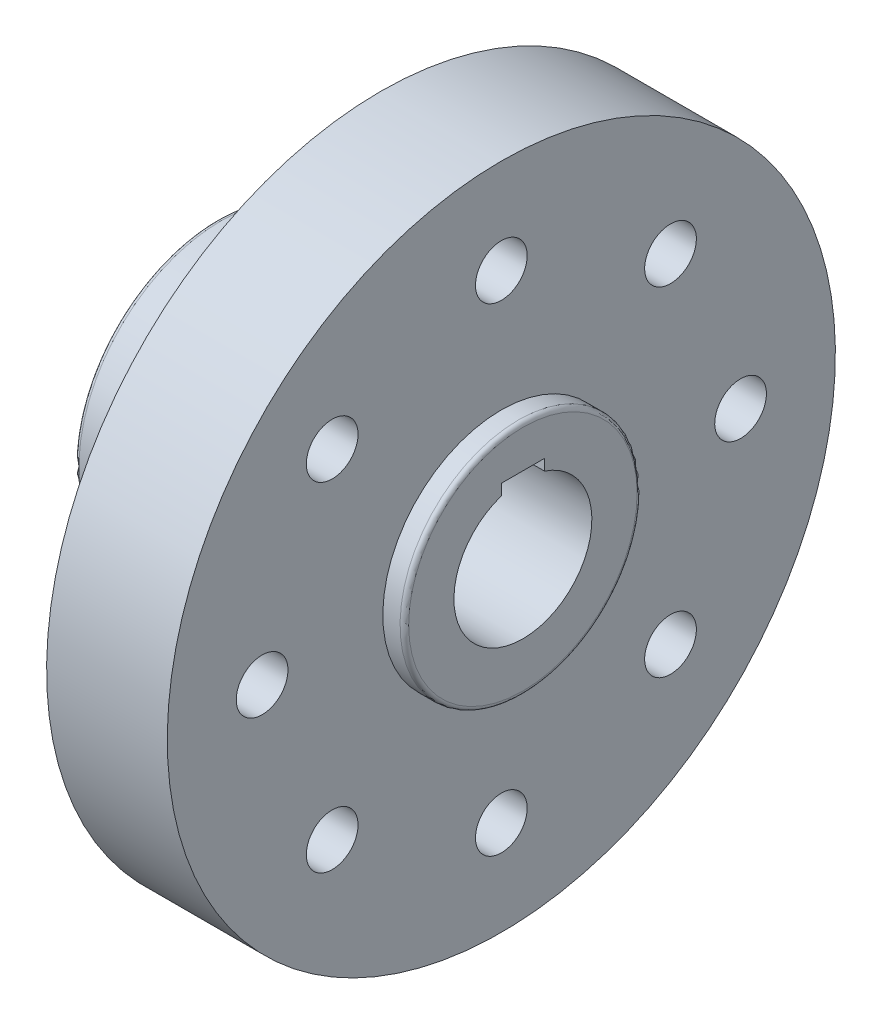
ISO-10303-21;
HEADER;
FILE_DESCRIPTION(('STEP AP214'),'2;1');
FILE_NAME('part.step','',(''),(''),'','','');
FILE_SCHEMA(('AUTOMOTIVE_DESIGN { 1 0 10303 214 1 1 1 1 }'));
ENDSEC;
DATA;
#1=APPLICATION_CONTEXT('core data for automotive mechanical design processes');
#2=APPLICATION_PROTOCOL_DEFINITION('international standard','automotive_design',2000,#1);
#3=PRODUCT_CONTEXT('',#1,'mechanical');
#4=PRODUCT('Part','Part','',(#3));
#5=PRODUCT_RELATED_PRODUCT_CATEGORY('part','',(#4));
#6=PRODUCT_DEFINITION_FORMATION('','',#4);
#7=PRODUCT_DEFINITION_CONTEXT('part definition',#1,'design');
#8=PRODUCT_DEFINITION('design','',#6,#7);
#9=PRODUCT_DEFINITION_SHAPE('','',#8);
#10=(LENGTH_UNIT() NAMED_UNIT(*) SI_UNIT(.MILLI.,.METRE.));
#11=(NAMED_UNIT(*) PLANE_ANGLE_UNIT() SI_UNIT($,.RADIAN.));
#12=(NAMED_UNIT(*) SI_UNIT($,.STERADIAN.) SOLID_ANGLE_UNIT());
#13=UNCERTAINTY_MEASURE_WITH_UNIT(LENGTH_MEASURE(1.E-05),#10,'distance_accuracy_value','');
#14=(GEOMETRIC_REPRESENTATION_CONTEXT(3) GLOBAL_UNCERTAINTY_ASSIGNED_CONTEXT((#13)) GLOBAL_UNIT_ASSIGNED_CONTEXT((#10,
#11,#12)) REPRESENTATION_CONTEXT('',''));
#15=CARTESIAN_POINT('',(0.,0.,0.));
#16=DIRECTION('',(0.,0.,1.));
#17=DIRECTION('',(1.,0.,0.));
#18=AXIS2_PLACEMENT_3D('',#15,#16,#17);
#19=CARTESIAN_POINT('',(29.1143281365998,0.,0.));
#20=DIRECTION('',(1.,0.,0.));
#21=DIRECTION('',(0.,1.,0.));
#22=AXIS2_PLACEMENT_3D('',#19,#20,#21);
#23=PLANE('',#22);
#24=CARTESIAN_POINT('',(29.1143281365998,0.,0.));
#25=DIRECTION('',(1.,0.,0.));
#26=DIRECTION('',(0.,1.,0.));
#27=AXIS2_PLACEMENT_3D('',#24,#25,#26);
#28=CIRCLE('',#27,26.5);
#29=CARTESIAN_POINT('',(29.1143281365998,26.5,0.));
#30=VERTEX_POINT('',#29);
#31=EDGE_CURVE('E240',#30,#30,#28,.T.);
#32=ORIENTED_EDGE('',*,*,#31,.T.);
#33=EDGE_LOOP('',(#32));
#34=FACE_BOUND('',#33,.T.);
#35=DIRECTION('',(0.,0.,-1.));
#36=VECTOR('',#35,1.);
#37=CARTESIAN_POINT('',(29.1143281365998,17.75,5.));
#38=LINE('',#37,#36);
#39=CARTESIAN_POINT('',(29.1143281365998,17.75,5.));
#40=VERTEX_POINT('',#39);
#41=CARTESIAN_POINT('',(29.1143281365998,17.75,-5.));
#42=VERTEX_POINT('',#41);
#43=EDGE_CURVE('E161',#40,#42,#38,.T.);
#44=ORIENTED_EDGE('',*,*,#43,.T.);
#45=DIRECTION('',(0.,-1.,0.));
#46=VECTOR('',#45,1.);
#47=CARTESIAN_POINT('',(29.1143281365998,17.75,-5.));
#48=LINE('',#47,#46);
#49=CARTESIAN_POINT('',(29.1143281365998,15.1986841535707,-5.));
#50=VERTEX_POINT('',#49);
#51=EDGE_CURVE('E140',#42,#50,#48,.T.);
#52=ORIENTED_EDGE('',*,*,#51,.T.);
#53=CARTESIAN_POINT('',(29.1143281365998,0.,0.));
#54=DIRECTION('',(1.,0.,0.));
#55=DIRECTION('',(0.,0.,-1.));
#56=AXIS2_PLACEMENT_3D('',#53,#54,#55);
#57=CIRCLE('',#56,16.);
#58=CARTESIAN_POINT('',(29.1143281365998,15.1986841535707,5.));
#59=VERTEX_POINT('',#58);
#60=EDGE_CURVE('E124',#59,#50,#57,.T.);
#61=ORIENTED_EDGE('',*,*,#60,.F.);
#62=DIRECTION('',(0.,-1.,0.));
#63=VECTOR('',#62,1.);
#64=CARTESIAN_POINT('',(29.1143281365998,17.75,5.));
#65=LINE('',#64,#63);
#66=EDGE_CURVE('E133',#40,#59,#65,.T.);
#67=ORIENTED_EDGE('',*,*,#66,.F.);
#68=EDGE_LOOP('',(#44,#52,#61,#67));
#69=FACE_BOUND('',#68,.T.);
#70=ADVANCED_FACE('F69',(#34,#69),#23,.T.);
#71=CARTESIAN_POINT('',(-41.8856718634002,33.,0.));
#72=DIRECTION('',(-1.,0.,0.));
#73=DIRECTION('',(0.,-1.,0.));
#74=AXIS2_PLACEMENT_3D('',#71,#72,#73);
#75=PLANE('',#74);
#76=CARTESIAN_POINT('',(-41.8856718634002,0.,0.));
#77=DIRECTION('',(-1.,0.,0.));
#78=DIRECTION('',(0.,-1.,0.));
#79=AXIS2_PLACEMENT_3D('',#76,#77,#78);
#80=CIRCLE('',#79,32.);
#81=CARTESIAN_POINT('',(-41.8856718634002,-32.,0.));
#82=VERTEX_POINT('',#81);
#83=EDGE_CURVE('E252',#82,#82,#80,.T.);
#84=ORIENTED_EDGE('',*,*,#83,.T.);
#85=EDGE_LOOP('',(#84));
#86=FACE_BOUND('',#85,.T.);
#87=DIRECTION('',(0.,-1.,0.));
#88=VECTOR('',#87,1.);
#89=CARTESIAN_POINT('',(-41.8856718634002,17.75,5.));
#90=LINE('',#89,#88);
#91=CARTESIAN_POINT('',(-41.8856718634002,17.75,5.));
#92=VERTEX_POINT('',#91);
#93=CARTESIAN_POINT('',(-41.8856718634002,17.2916164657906,5.));
#94=VERTEX_POINT('',#93);
#95=EDGE_CURVE('E156',#92,#94,#90,.T.);
#96=ORIENTED_EDGE('',*,*,#95,.T.);
#97=CARTESIAN_POINT('',(-41.8856718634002,0.,0.));
#98=DIRECTION('',(-1.,0.,0.));
#99=DIRECTION('',(0.,-1.,0.));
#100=AXIS2_PLACEMENT_3D('',#97,#98,#99);
#101=CIRCLE('',#100,18.);
#102=CARTESIAN_POINT('',(-41.8856718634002,17.2916164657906,-5.));
#103=VERTEX_POINT('',#102);
#104=EDGE_CURVE('E256',#94,#103,#101,.F.);
#105=ORIENTED_EDGE('',*,*,#104,.T.);
#106=DIRECTION('',(0.,-1.,0.));
#107=VECTOR('',#106,1.);
#108=CARTESIAN_POINT('',(-41.8856718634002,17.75,-5.));
#109=LINE('',#108,#107);
#110=CARTESIAN_POINT('',(-41.8856718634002,17.75,-5.));
#111=VERTEX_POINT('',#110);
#112=EDGE_CURVE('E160',#111,#103,#109,.T.);
#113=ORIENTED_EDGE('',*,*,#112,.F.);
#114=DIRECTION('',(0.,0.,-1.));
#115=VECTOR('',#114,1.);
#116=CARTESIAN_POINT('',(-41.8856718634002,17.75,5.));
#117=LINE('',#116,#115);
#118=EDGE_CURVE('E164',#92,#111,#117,.T.);
#119=ORIENTED_EDGE('',*,*,#118,.F.);
#120=EDGE_LOOP('',(#96,#105,#113,#119));
#121=FACE_BOUND('',#120,.T.);
#122=ADVANCED_FACE('F276',(#86,#121),#75,.T.);
#123=CARTESIAN_POINT('',(29.1143281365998,0.,0.));
#124=DIRECTION('',(1.,0.,0.));
#125=DIRECTION('',(0.,1.,0.));
#126=AXIS2_PLACEMENT_3D('',#123,#124,#125);
#127=CYLINDRICAL_SURFACE('',#126,27.5);
#128=CARTESIAN_POINT('',(28.1143281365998,0.,0.));
#129=DIRECTION('',(1.,0.,0.));
#130=DIRECTION('',(0.,1.,0.));
#131=AXIS2_PLACEMENT_3D('',#128,#129,#130);
#132=CIRCLE('',#131,27.5);
#133=CARTESIAN_POINT('',(28.1143281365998,27.5,0.));
#134=VERTEX_POINT('',#133);
#135=EDGE_CURVE('E244',#134,#134,#132,.F.);
#136=ORIENTED_EDGE('',*,*,#135,.T.);
#137=EDGE_LOOP('',(#136));
#138=FACE_BOUND('',#137,.T.);
#139=CARTESIAN_POINT('',(24.1143281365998,0.,0.));
#140=DIRECTION('',(1.,0.,0.));
#141=DIRECTION('',(0.,1.,0.));
#142=AXIS2_PLACEMENT_3D('',#139,#140,#141);
#143=CIRCLE('',#142,27.5);
#144=CARTESIAN_POINT('',(24.1143281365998,27.5,0.));
#145=VERTEX_POINT('',#144);
#146=EDGE_CURVE('E180',#145,#145,#143,.T.);
#147=ORIENTED_EDGE('',*,*,#146,.T.);
#148=EDGE_LOOP('',(#147));
#149=FACE_BOUND('',#148,.T.);
#150=ADVANCED_FACE('F279',(#138,#149),#127,.T.);
#151=CARTESIAN_POINT('',(24.1143281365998,27.5,0.));
#152=DIRECTION('',(1.,0.,0.));
#153=DIRECTION('',(0.,1.,0.));
#154=AXIS2_PLACEMENT_3D('',#151,#152,#153);
#155=PLANE('',#154);
#156=CARTESIAN_POINT('',(24.1143281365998,55.5,0.));
#157=DIRECTION('',(1.,0.,0.));
#158=DIRECTION('',(0.,1.,0.));
#159=AXIS2_PLACEMENT_3D('',#156,#157,#158);
#160=CIRCLE('',#159,6.);
#161=CARTESIAN_POINT('',(24.1143281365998,61.5,0.));
#162=VERTEX_POINT('',#161);
#163=EDGE_CURVE('E190',#162,#162,#160,.T.);
#164=ORIENTED_EDGE('',*,*,#163,.F.);
#165=EDGE_LOOP('',(#164));
#166=FACE_BOUND('',#165,.T.);
#167=CARTESIAN_POINT('',(24.1143281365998,39.2444263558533,-39.2444263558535));
#168=DIRECTION('',(1.,0.,0.));
#169=DIRECTION('',(0.,1.,0.));
#170=AXIS2_PLACEMENT_3D('',#167,#168,#169);
#171=CIRCLE('',#170,6.);
#172=CARTESIAN_POINT('',(24.1143281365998,45.2444263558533,-39.2444263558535));
#173=VERTEX_POINT('',#172);
#174=EDGE_CURVE('E389',#173,#173,#171,.T.);
#175=ORIENTED_EDGE('',*,*,#174,.F.);
#176=EDGE_LOOP('',(#175));
#177=FACE_BOUND('',#176,.T.);
#178=CARTESIAN_POINT('',(24.1143281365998,-1.96909090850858E-13,-55.5));
#179=DIRECTION('',(1.,0.,0.));
#180=DIRECTION('',(0.,1.,0.));
#181=AXIS2_PLACEMENT_3D('',#178,#179,#180);
#182=CIRCLE('',#181,6.);
#183=CARTESIAN_POINT('',(24.1143281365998,5.9999999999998,-55.5));
#184=VERTEX_POINT('',#183);
#185=EDGE_CURVE('E385',#184,#184,#182,.T.);
#186=ORIENTED_EDGE('',*,*,#185,.F.);
#187=EDGE_LOOP('',(#186));
#188=FACE_BOUND('',#187,.T.);
#189=CARTESIAN_POINT('',(24.1143281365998,-39.2444263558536,-39.2444263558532));
#190=DIRECTION('',(1.,0.,0.));
#191=DIRECTION('',(0.,1.,0.));
#192=AXIS2_PLACEMENT_3D('',#189,#190,#191);
#193=CIRCLE('',#192,6.);
#194=CARTESIAN_POINT('',(24.1143281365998,-33.2444263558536,-39.2444263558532));
#195=VERTEX_POINT('',#194);
#196=EDGE_CURVE('E381',#195,#195,#193,.T.);
#197=ORIENTED_EDGE('',*,*,#196,.F.);
#198=EDGE_LOOP('',(#197));
#199=FACE_BOUND('',#198,.T.);
#200=CARTESIAN_POINT('',(24.1143281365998,-55.5,3.90248651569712E-13));
#201=DIRECTION('',(1.,0.,0.));
#202=DIRECTION('',(0.,1.,0.));
#203=AXIS2_PLACEMENT_3D('',#200,#201,#202);
#204=CIRCLE('',#203,6.);
#205=CARTESIAN_POINT('',(24.1143281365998,-49.5,3.90248651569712E-13));
#206=VERTEX_POINT('',#205);
#207=EDGE_CURVE('E375',#206,#206,#204,.T.);
#208=ORIENTED_EDGE('',*,*,#207,.F.);
#209=EDGE_LOOP('',(#208));
#210=FACE_BOUND('',#209,.T.);
#211=CARTESIAN_POINT('',(24.1143281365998,-39.2444263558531,39.2444263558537));
#212=DIRECTION('',(1.,0.,0.));
#213=DIRECTION('',(0.,1.,0.));
#214=AXIS2_PLACEMENT_3D('',#211,#212,#213);
#215=CIRCLE('',#214,6.00000000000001);
#216=CARTESIAN_POINT('',(24.1143281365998,-33.244426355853,39.2444263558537));
#217=VERTEX_POINT('',#216);
#218=EDGE_CURVE('E370',#217,#217,#215,.T.);
#219=ORIENTED_EDGE('',*,*,#218,.F.);
#220=EDGE_LOOP('',(#219));
#221=FACE_BOUND('',#220,.T.);
#222=CARTESIAN_POINT('',(24.1143281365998,5.83588212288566E-13,55.5));
#223=DIRECTION('',(1.,0.,0.));
#224=DIRECTION('',(0.,1.,0.));
#225=AXIS2_PLACEMENT_3D('',#222,#223,#224);
#226=CIRCLE('',#225,6.);
#227=CARTESIAN_POINT('',(24.1143281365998,6.00000000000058,55.5));
#228=VERTEX_POINT('',#227);
#229=EDGE_CURVE('E367',#228,#228,#226,.T.);
#230=ORIENTED_EDGE('',*,*,#229,.F.);
#231=EDGE_LOOP('',(#230));
#232=FACE_BOUND('',#231,.T.);
#233=CARTESIAN_POINT('',(24.1143281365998,39.2444263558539,39.2444263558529));
#234=DIRECTION('',(1.,0.,0.));
#235=DIRECTION('',(0.,1.,0.));
#236=AXIS2_PLACEMENT_3D('',#233,#234,#235);
#237=CIRCLE('',#236,6.);
#238=CARTESIAN_POINT('',(24.1143281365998,45.2444263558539,39.2444263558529));
#239=VERTEX_POINT('',#238);
#240=EDGE_CURVE('E151',#239,#239,#237,.T.);
#241=ORIENTED_EDGE('',*,*,#240,.F.);
#242=EDGE_LOOP('',(#241));
#243=FACE_BOUND('',#242,.T.);
#244=CARTESIAN_POINT('',(24.1143281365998,0.,0.));
#245=DIRECTION('',(1.,0.,0.));
#246=DIRECTION('',(0.,1.,0.));
#247=AXIS2_PLACEMENT_3D('',#244,#245,#246);
#248=CIRCLE('',#247,77.5);
#249=CARTESIAN_POINT('',(24.1143281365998,77.5,0.));
#250=VERTEX_POINT('',#249);
#251=EDGE_CURVE('E176',#250,#250,#248,.T.);
#252=ORIENTED_EDGE('',*,*,#251,.T.);
#253=EDGE_LOOP('',(#252));
#254=FACE_BOUND('',#253,.T.);
#255=ORIENTED_EDGE('',*,*,#146,.F.);
#256=EDGE_LOOP('',(#255));
#257=FACE_BOUND('',#256,.T.);
#258=ADVANCED_FACE('F300',(#166,#177,#188,#199,#210,#221,#232,#243,#254,#257),#155,.T.);
#259=CARTESIAN_POINT('',(29.1143281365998,0.,0.));
#260=DIRECTION('',(1.,0.,0.));
#261=DIRECTION('',(0.,1.,0.));
#262=AXIS2_PLACEMENT_3D('',#259,#260,#261);
#263=CYLINDRICAL_SURFACE('',#262,77.5);
#264=CARTESIAN_POINT('',(-3.88567186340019,0.,0.));
#265=DIRECTION('',(1.,0.,0.));
#266=DIRECTION('',(0.,1.,0.));
#267=AXIS2_PLACEMENT_3D('',#264,#265,#266);
#268=CIRCLE('',#267,77.5);
#269=CARTESIAN_POINT('',(-3.88567186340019,77.5,0.));
#270=VERTEX_POINT('',#269);
#271=EDGE_CURVE('E154',#270,#270,#268,.T.);
#272=ORIENTED_EDGE('',*,*,#271,.T.);
#273=EDGE_LOOP('',(#272));
#274=FACE_BOUND('',#273,.T.);
#275=ORIENTED_EDGE('',*,*,#251,.F.);
#276=EDGE_LOOP('',(#275));
#277=FACE_BOUND('',#276,.T.);
#278=ADVANCED_FACE('F296',(#274,#277),#263,.T.);
#279=CARTESIAN_POINT('',(-3.88567186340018,77.5,0.));
#280=DIRECTION('',(-1.,0.,0.));
#281=DIRECTION('',(0.,-1.,0.));
#282=AXIS2_PLACEMENT_3D('',#279,#280,#281);
#283=PLANE('',#282);
#284=CARTESIAN_POINT('',(-3.88567186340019,0.,0.));
#285=DIRECTION('',(-1.,0.,0.));
#286=DIRECTION('',(0.,-1.,0.));
#287=AXIS2_PLACEMENT_3D('',#284,#285,#286);
#288=CIRCLE('',#287,75.5);
#289=CARTESIAN_POINT('',(-3.88567186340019,-75.5,0.));
#290=VERTEX_POINT('',#289);
#291=EDGE_CURVE('E232',#290,#290,#288,.F.);
#292=ORIENTED_EDGE('',*,*,#291,.T.);
#293=EDGE_LOOP('',(#292));
#294=FACE_BOUND('',#293,.T.);
#295=ORIENTED_EDGE('',*,*,#271,.F.);
#296=EDGE_LOOP('',(#295));
#297=FACE_BOUND('',#296,.T.);
#298=ADVANCED_FACE('F292',(#294,#297),#283,.T.);
#299=CARTESIAN_POINT('',(29.1143281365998,0.,0.));
#300=DIRECTION('',(1.,0.,0.));
#301=DIRECTION('',(0.,1.,0.));
#302=AXIS2_PLACEMENT_3D('',#299,#300,#301);
#303=CYLINDRICAL_SURFACE('',#302,74.5);
#304=CARTESIAN_POINT('',(-2.88567186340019,0.,0.));
#305=DIRECTION('',(-1.,0.,0.));
#306=DIRECTION('',(0.,-1.,0.));
#307=AXIS2_PLACEMENT_3D('',#304,#305,#306);
#308=CIRCLE('',#307,74.5);
#309=CARTESIAN_POINT('',(-2.88567186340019,-74.5,0.));
#310=VERTEX_POINT('',#309);
#311=EDGE_CURVE('E236',#310,#310,#308,.T.);
#312=ORIENTED_EDGE('',*,*,#311,.T.);
#313=EDGE_LOOP('',(#312));
#314=FACE_BOUND('',#313,.T.);
#315=CARTESIAN_POINT('',(8.11432813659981,0.,0.));
#316=DIRECTION('',(-1.,0.,0.));
#317=DIRECTION('',(0.,-1.,0.));
#318=AXIS2_PLACEMENT_3D('',#315,#316,#317);
#319=CIRCLE('',#318,74.5);
#320=CARTESIAN_POINT('',(8.11432813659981,-74.5,0.));
#321=VERTEX_POINT('',#320);
#322=EDGE_CURVE('E224',#321,#321,#319,.F.);
#323=ORIENTED_EDGE('',*,*,#322,.T.);
#324=EDGE_LOOP('',(#323));
#325=FACE_BOUND('',#324,.T.);
#326=ADVANCED_FACE('F288',(#314,#325),#303,.F.);
#327=CARTESIAN_POINT('',(10.1143281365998,74.5,0.));
#328=DIRECTION('',(-1.,0.,0.));
#329=DIRECTION('',(0.,-1.,0.));
#330=AXIS2_PLACEMENT_3D('',#327,#328,#329);
#331=PLANE('',#330);
#332=CARTESIAN_POINT('',(10.1143281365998,0.,0.));
#333=DIRECTION('',(-1.,0.,0.));
#334=DIRECTION('',(0.,-1.,0.));
#335=AXIS2_PLACEMENT_3D('',#332,#333,#334);
#336=CIRCLE('',#335,72.5);
#337=CARTESIAN_POINT('',(10.1143281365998,-72.5,0.));
#338=VERTEX_POINT('',#337);
#339=EDGE_CURVE('E228',#338,#338,#336,.T.);
#340=ORIENTED_EDGE('',*,*,#339,.T.);
#341=EDGE_LOOP('',(#340));
#342=FACE_BOUND('',#341,.T.);
#343=CARTESIAN_POINT('',(10.1143281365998,0.,0.));
#344=DIRECTION('',(-1.,0.,0.));
#345=DIRECTION('',(0.,-1.,0.));
#346=AXIS2_PLACEMENT_3D('',#343,#344,#345);
#347=CIRCLE('',#346,38.);
#348=CARTESIAN_POINT('',(10.1143281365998,-38.,0.));
#349=VERTEX_POINT('',#348);
#350=EDGE_CURVE('E184',#349,#349,#347,.F.);
#351=ORIENTED_EDGE('',*,*,#350,.T.);
#352=EDGE_LOOP('',(#351));
#353=FACE_BOUND('',#352,.T.);
#354=CARTESIAN_POINT('',(10.1143281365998,55.5,0.));
#355=DIRECTION('',(-1.,0.,0.));
#356=DIRECTION('',(0.,-1.,0.));
#357=AXIS2_PLACEMENT_3D('',#354,#355,#356);
#358=CIRCLE('',#357,6.);
#359=CARTESIAN_POINT('',(10.1143281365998,49.5,0.));
#360=VERTEX_POINT('',#359);
#361=EDGE_CURVE('E141',#360,#360,#358,.T.);
#362=ORIENTED_EDGE('',*,*,#361,.F.);
#363=EDGE_LOOP('',(#362));
#364=FACE_BOUND('',#363,.T.);
#365=CARTESIAN_POINT('',(10.1143281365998,39.2444263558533,-39.2444263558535));
#366=DIRECTION('',(-1.,0.,0.));
#367=DIRECTION('',(0.,-1.,0.));
#368=AXIS2_PLACEMENT_3D('',#365,#366,#367);
#369=CIRCLE('',#368,6.);
#370=CARTESIAN_POINT('',(10.1143281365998,33.2444263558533,-39.2444263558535));
#371=VERTEX_POINT('',#370);
#372=EDGE_CURVE('E210',#371,#371,#369,.T.);
#373=ORIENTED_EDGE('',*,*,#372,.F.);
#374=EDGE_LOOP('',(#373));
#375=FACE_BOUND('',#374,.T.);
#376=CARTESIAN_POINT('',(10.1143281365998,-1.96655003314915E-13,-55.5));
#377=DIRECTION('',(-1.,0.,0.));
#378=DIRECTION('',(0.,-1.,0.));
#379=AXIS2_PLACEMENT_3D('',#376,#377,#378);
#380=CIRCLE('',#379,6.);
#381=CARTESIAN_POINT('',(10.1143281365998,-6.0000000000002,-55.5));
#382=VERTEX_POINT('',#381);
#383=EDGE_CURVE('E206',#382,#382,#380,.T.);
#384=ORIENTED_EDGE('',*,*,#383,.F.);
#385=EDGE_LOOP('',(#384));
#386=FACE_BOUND('',#385,.T.);
#387=CARTESIAN_POINT('',(10.1143281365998,-39.2444263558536,-39.2444263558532));
#388=DIRECTION('',(-1.,0.,0.));
#389=DIRECTION('',(0.,-1.,0.));
#390=AXIS2_PLACEMENT_3D('',#387,#388,#389);
#391=CIRCLE('',#390,6.);
#392=CARTESIAN_POINT('',(10.1143281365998,-45.2444263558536,-39.2444263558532));
#393=VERTEX_POINT('',#392);
#394=EDGE_CURVE('E202',#393,#393,#391,.T.);
#395=ORIENTED_EDGE('',*,*,#394,.F.);
#396=EDGE_LOOP('',(#395));
#397=FACE_BOUND('',#396,.T.);
#398=CARTESIAN_POINT('',(10.1143281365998,-55.5,3.90248651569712E-13));
#399=DIRECTION('',(-1.,0.,0.));
#400=DIRECTION('',(0.,-1.,0.));
#401=AXIS2_PLACEMENT_3D('',#398,#399,#400);
#402=CIRCLE('',#401,6.);
#403=CARTESIAN_POINT('',(10.1143281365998,-61.5,3.90248651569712E-13));
#404=VERTEX_POINT('',#403);
#405=EDGE_CURVE('E198',#404,#404,#402,.T.);
#406=ORIENTED_EDGE('',*,*,#405,.F.);
#407=EDGE_LOOP('',(#406));
#408=FACE_BOUND('',#407,.T.);
#409=CARTESIAN_POINT('',(10.1143281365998,-39.2444263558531,39.2444263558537));
#410=DIRECTION('',(-1.,0.,0.));
#411=DIRECTION('',(0.,-1.,0.));
#412=AXIS2_PLACEMENT_3D('',#409,#410,#411);
#413=CIRCLE('',#412,6.00000000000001);
#414=CARTESIAN_POINT('',(10.1143281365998,-45.2444263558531,39.2444263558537));
#415=VERTEX_POINT('',#414);
#416=EDGE_CURVE('E194',#415,#415,#413,.T.);
#417=ORIENTED_EDGE('',*,*,#416,.F.);
#418=EDGE_LOOP('',(#417));
#419=FACE_BOUND('',#418,.T.);
#420=CARTESIAN_POINT('',(10.1143281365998,5.83842299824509E-13,55.5));
#421=DIRECTION('',(-1.,0.,0.));
#422=DIRECTION('',(0.,-1.,0.));
#423=AXIS2_PLACEMENT_3D('',#420,#421,#422);
#424=CIRCLE('',#423,6.);
#425=CARTESIAN_POINT('',(10.1143281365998,-5.99999999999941,55.5));
#426=VERTEX_POINT('',#425);
#427=EDGE_CURVE('E189',#426,#426,#424,.T.);
#428=ORIENTED_EDGE('',*,*,#427,.F.);
#429=EDGE_LOOP('',(#428));
#430=FACE_BOUND('',#429,.T.);
#431=CARTESIAN_POINT('',(10.1143281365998,39.2444263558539,39.2444263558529));
#432=DIRECTION('',(-1.,0.,0.));
#433=DIRECTION('',(0.,-1.,0.));
#434=AXIS2_PLACEMENT_3D('',#431,#432,#433);
#435=CIRCLE('',#434,6.);
#436=CARTESIAN_POINT('',(10.1143281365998,33.2444263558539,39.2444263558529));
#437=VERTEX_POINT('',#436);
#438=EDGE_CURVE('E185',#437,#437,#435,.T.);
#439=ORIENTED_EDGE('',*,*,#438,.F.);
#440=EDGE_LOOP('',(#439));
#441=FACE_BOUND('',#440,.T.);
#442=ADVANCED_FACE('F284',(#342,#353,#364,#375,#386,#397,#408,#419,#430,#441),#331,.T.);
#443=CARTESIAN_POINT('',(29.1143281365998,0.,0.));
#444=DIRECTION('',(1.,0.,0.));
#445=DIRECTION('',(0.,1.,0.));
#446=AXIS2_PLACEMENT_3D('',#443,#444,#445);
#447=CYLINDRICAL_SURFACE('',#446,33.);
#448=CARTESIAN_POINT('',(-40.8856718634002,0.,0.));
#449=DIRECTION('',(-1.,0.,0.));
#450=DIRECTION('',(0.,-1.,0.));
#451=AXIS2_PLACEMENT_3D('',#448,#449,#450);
#452=CIRCLE('',#451,33.);
#453=CARTESIAN_POINT('',(-40.8856718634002,-33.,0.));
#454=VERTEX_POINT('',#453);
#455=EDGE_CURVE('E248',#454,#454,#452,.F.);
#456=ORIENTED_EDGE('',*,*,#455,.T.);
#457=EDGE_LOOP('',(#456));
#458=FACE_BOUND('',#457,.T.);
#459=CARTESIAN_POINT('',(5.11432813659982,0.,0.));
#460=DIRECTION('',(-1.,0.,0.));
#461=DIRECTION('',(0.,-1.,0.));
#462=AXIS2_PLACEMENT_3D('',#459,#460,#461);
#463=CIRCLE('',#462,33.);
#464=CARTESIAN_POINT('',(5.11432813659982,-33.,0.));
#465=VERTEX_POINT('',#464);
#466=EDGE_CURVE('E220',#465,#465,#463,.T.);
#467=ORIENTED_EDGE('',*,*,#466,.T.);
#468=EDGE_LOOP('',(#467));
#469=FACE_BOUND('',#468,.T.);
#470=ADVANCED_FACE('F281',(#458,#469),#447,.T.);
#471=CARTESIAN_POINT('',(-41.8856718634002,0.,0.));
#472=DIRECTION('',(1.,0.,0.));
#473=DIRECTION('',(0.,1.,0.));
#474=AXIS2_PLACEMENT_3D('',#471,#472,#473);
#475=CYLINDRICAL_SURFACE('',#474,16.);
#476=DIRECTION('',(1.,0.,0.));
#477=VECTOR('',#476,1.);
#478=CARTESIAN_POINT('',(-41.8856718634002,15.1986841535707,-5.));
#479=LINE('',#478,#477);
#480=CARTESIAN_POINT('',(-39.8856718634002,15.1986841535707,-5.));
#481=VERTEX_POINT('',#480);
#482=EDGE_CURVE('E129',#481,#50,#479,.T.);
#483=ORIENTED_EDGE('',*,*,#482,.F.);
#484=CARTESIAN_POINT('',(-39.8856718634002,0.,0.));
#485=DIRECTION('',(-1.,0.,0.));
#486=DIRECTION('',(0.,-1.,0.));
#487=AXIS2_PLACEMENT_3D('',#484,#485,#486);
#488=CIRCLE('',#487,16.);
#489=CARTESIAN_POINT('',(-39.8856718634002,15.1986841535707,5.));
#490=VERTEX_POINT('',#489);
#491=EDGE_CURVE('E85',#481,#490,#488,.T.);
#492=ORIENTED_EDGE('',*,*,#491,.T.);
#493=DIRECTION('',(1.,0.,0.));
#494=VECTOR('',#493,1.);
#495=CARTESIAN_POINT('',(-41.8856718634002,15.1986841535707,5.));
#496=LINE('',#495,#494);
#497=EDGE_CURVE('E120',#490,#59,#496,.T.);
#498=ORIENTED_EDGE('',*,*,#497,.T.);
#499=ORIENTED_EDGE('',*,*,#60,.T.);
#500=EDGE_LOOP('',(#483,#492,#498,#499));
#501=FACE_BOUND('',#500,.T.);
#502=ADVANCED_FACE('F122',(#501),#475,.F.);
#503=CARTESIAN_POINT('',(-41.8856718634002,17.75,5.));
#504=DIRECTION('',(0.,-1.,0.));
#505=DIRECTION('',(1.,0.,0.));
#506=AXIS2_PLACEMENT_3D('',#503,#504,#505);
#507=PLANE('',#506);
#508=ORIENTED_EDGE('',*,*,#43,.F.);
#509=DIRECTION('',(1.,0.,0.));
#510=VECTOR('',#509,1.);
#511=CARTESIAN_POINT('',(-41.8856718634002,17.75,5.));
#512=LINE('',#511,#510);
#513=EDGE_CURVE('E136',#92,#40,#512,.T.);
#514=ORIENTED_EDGE('',*,*,#513,.F.);
#515=ORIENTED_EDGE('',*,*,#118,.T.);
#516=DIRECTION('',(1.,0.,0.));
#517=VECTOR('',#516,1.);
#518=CARTESIAN_POINT('',(-41.8856718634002,17.75,-5.));
#519=LINE('',#518,#517);
#520=EDGE_CURVE('E147',#111,#42,#519,.T.);
#521=ORIENTED_EDGE('',*,*,#520,.T.);
#522=EDGE_LOOP('',(#508,#514,#515,#521));
#523=FACE_BOUND('',#522,.T.);
#524=ADVANCED_FACE('F270',(#523),#507,.T.);
#525=CARTESIAN_POINT('',(-41.8856718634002,17.75,-5.));
#526=DIRECTION('',(0.,0.,1.));
#527=DIRECTION('',(1.,0.,0.));
#528=AXIS2_PLACEMENT_3D('',#525,#526,#527);
#529=PLANE('',#528);
#530=ORIENTED_EDGE('',*,*,#112,.T.);
#531=CARTESIAN_POINT('',(-41.8856718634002,17.2916164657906,-5.));
#532=CARTESIAN_POINT('',(-41.718546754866,17.1176440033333,-5.));
#533=CARTESIAN_POINT('',(-41.5515220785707,16.9435750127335,-5.));
#534=CARTESIAN_POINT('',(-41.2176945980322,16.5952250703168,-5.));
#535=CARTESIAN_POINT('',(-41.0508917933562,16.4209441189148,-5.));
#536=CARTESIAN_POINT('',(-40.7175283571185,16.0721506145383,-5.));
#537=CARTESIAN_POINT('',(-40.5509677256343,15.8976380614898,-5.));
#538=CARTESIAN_POINT('',(-40.2181133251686,15.5483580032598,-5.));
#539=CARTESIAN_POINT('',(-40.0518195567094,15.3735904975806,-5.));
#540=CARTESIAN_POINT('',(-39.8856718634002,15.1986841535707,-5.));
#541=B_SPLINE_CURVE_WITH_KNOTS('',3,(#531,#532,#533,#534,#535,#536,#537,#538,#539,#540),
.UNSPECIFIED.,.F.,.F.,(4,2,2,2,4),(0.,0.723723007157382,1.44744460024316,2.17116642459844,
2.89488966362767),.UNSPECIFIED.);
#542=EDGE_CURVE('E99',#103,#481,#541,.T.);
#543=ORIENTED_EDGE('',*,*,#542,.T.);
#544=ORIENTED_EDGE('',*,*,#482,.T.);
#545=ORIENTED_EDGE('',*,*,#51,.F.);
#546=ORIENTED_EDGE('',*,*,#520,.F.);
#547=EDGE_LOOP('',(#530,#543,#544,#545,#546));
#548=FACE_BOUND('',#547,.T.);
#549=ADVANCED_FACE('F266',(#548),#529,.T.);
#550=CARTESIAN_POINT('',(-41.8856718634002,17.75,5.));
#551=DIRECTION('',(0.,0.,1.));
#552=DIRECTION('',(1.,0.,0.));
#553=AXIS2_PLACEMENT_3D('',#550,#551,#552);
#554=PLANE('',#553);
#555=ORIENTED_EDGE('',*,*,#497,.F.);
#556=CARTESIAN_POINT('',(-39.8856718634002,15.1986841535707,5.));
#557=CARTESIAN_POINT('',(-40.0518195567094,15.3735904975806,5.));
#558=CARTESIAN_POINT('',(-40.2181133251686,15.5483580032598,5.));
#559=CARTESIAN_POINT('',(-40.5509677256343,15.8976380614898,5.));
#560=CARTESIAN_POINT('',(-40.7175283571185,16.0721506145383,5.));
#561=CARTESIAN_POINT('',(-41.0508917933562,16.4209441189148,5.));
#562=CARTESIAN_POINT('',(-41.2176945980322,16.5952250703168,5.));
#563=CARTESIAN_POINT('',(-41.5515220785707,16.9435750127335,5.));
#564=CARTESIAN_POINT('',(-41.718546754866,17.1176440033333,5.));
#565=CARTESIAN_POINT('',(-41.8856718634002,17.2916164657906,5.));
#566=B_SPLINE_CURVE_WITH_KNOTS('',3,(#556,#557,#558,#559,#560,#561,#562,#563,#564,#565),
.UNSPECIFIED.,.F.,.F.,(4,2,2,2,4),(0.,0.723723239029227,1.4474450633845,2.17116665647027,
2.89488966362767),.UNSPECIFIED.);
#567=EDGE_CURVE('E12',#490,#94,#566,.T.);
#568=ORIENTED_EDGE('',*,*,#567,.T.);
#569=ORIENTED_EDGE('',*,*,#95,.F.);
#570=ORIENTED_EDGE('',*,*,#513,.T.);
#571=ORIENTED_EDGE('',*,*,#66,.T.);
#572=EDGE_LOOP('',(#555,#568,#569,#570,#571));
#573=FACE_BOUND('',#572,.T.);
#574=ADVANCED_FACE('F134',(#573),#554,.F.);
#575=CARTESIAN_POINT('',(-41.8856718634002,39.2444263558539,39.2444263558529));
#576=DIRECTION('',(1.,0.,0.));
#577=DIRECTION('',(0.,1.,0.));
#578=AXIS2_PLACEMENT_3D('',#575,#576,#577);
#579=CYLINDRICAL_SURFACE('',#578,6.);
#580=ORIENTED_EDGE('',*,*,#438,.T.);
#581=EDGE_LOOP('',(#580));
#582=FACE_BOUND('',#581,.T.);
#583=ORIENTED_EDGE('',*,*,#240,.T.);
#584=EDGE_LOOP('',(#583));
#585=FACE_BOUND('',#584,.T.);
#586=ADVANCED_FACE('F275',(#582,#585),#579,.F.);
#587=CARTESIAN_POINT('',(-41.8856718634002,5.84786053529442E-13,55.5));
#588=DIRECTION('',(1.,0.,0.));
#589=DIRECTION('',(0.,1.,0.));
#590=AXIS2_PLACEMENT_3D('',#587,#588,#589);
#591=CYLINDRICAL_SURFACE('',#590,6.);
#592=ORIENTED_EDGE('',*,*,#427,.T.);
#593=EDGE_LOOP('',(#592));
#594=FACE_BOUND('',#593,.T.);
#595=ORIENTED_EDGE('',*,*,#229,.T.);
#596=EDGE_LOOP('',(#595));
#597=FACE_BOUND('',#596,.T.);
#598=ADVANCED_FACE('F361',(#594,#597),#591,.F.);
#599=CARTESIAN_POINT('',(-41.8856718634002,-39.2444263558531,39.2444263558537));
#600=DIRECTION('',(1.,0.,0.));
#601=DIRECTION('',(0.,1.,0.));
#602=AXIS2_PLACEMENT_3D('',#599,#600,#601);
#603=CYLINDRICAL_SURFACE('',#602,6.00000000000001);
#604=ORIENTED_EDGE('',*,*,#416,.T.);
#605=EDGE_LOOP('',(#604));
#606=FACE_BOUND('',#605,.T.);
#607=ORIENTED_EDGE('',*,*,#218,.T.);
#608=EDGE_LOOP('',(#607));
#609=FACE_BOUND('',#608,.T.);
#610=ADVANCED_FACE('F415',(#606,#609),#603,.F.);
#611=CARTESIAN_POINT('',(-41.8856718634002,-55.5,3.90248651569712E-13));
#612=DIRECTION('',(1.,0.,0.));
#613=DIRECTION('',(0.,1.,0.));
#614=AXIS2_PLACEMENT_3D('',#611,#612,#613);
#615=CYLINDRICAL_SURFACE('',#614,6.);
#616=ORIENTED_EDGE('',*,*,#405,.T.);
#617=EDGE_LOOP('',(#616));
#618=FACE_BOUND('',#617,.T.);
#619=ORIENTED_EDGE('',*,*,#207,.T.);
#620=EDGE_LOOP('',(#619));
#621=FACE_BOUND('',#620,.T.);
#622=ADVANCED_FACE('F417',(#618,#621),#615,.F.);
#623=CARTESIAN_POINT('',(-41.8856718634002,-39.2444263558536,-39.2444263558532));
#624=DIRECTION('',(1.,0.,0.));
#625=DIRECTION('',(0.,1.,0.));
#626=AXIS2_PLACEMENT_3D('',#623,#624,#625);
#627=CYLINDRICAL_SURFACE('',#626,6.);
#628=ORIENTED_EDGE('',*,*,#394,.T.);
#629=EDGE_LOOP('',(#628));
#630=FACE_BOUND('',#629,.T.);
#631=ORIENTED_EDGE('',*,*,#196,.T.);
#632=EDGE_LOOP('',(#631));
#633=FACE_BOUND('',#632,.T.);
#634=ADVANCED_FACE('F424',(#630,#633),#627,.F.);
#635=CARTESIAN_POINT('',(-41.8856718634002,-1.95711249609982E-13,-55.5));
#636=DIRECTION('',(1.,0.,0.));
#637=DIRECTION('',(0.,1.,0.));
#638=AXIS2_PLACEMENT_3D('',#635,#636,#637);
#639=CYLINDRICAL_SURFACE('',#638,6.);
#640=ORIENTED_EDGE('',*,*,#383,.T.);
#641=EDGE_LOOP('',(#640));
#642=FACE_BOUND('',#641,.T.);
#643=ORIENTED_EDGE('',*,*,#185,.T.);
#644=EDGE_LOOP('',(#643));
#645=FACE_BOUND('',#644,.T.);
#646=ADVANCED_FACE('F484',(#642,#645),#639,.F.);
#647=CARTESIAN_POINT('',(-41.8856718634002,39.2444263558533,-39.2444263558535));
#648=DIRECTION('',(1.,0.,0.));
#649=DIRECTION('',(0.,1.,0.));
#650=AXIS2_PLACEMENT_3D('',#647,#648,#649);
#651=CYLINDRICAL_SURFACE('',#650,6.);
#652=ORIENTED_EDGE('',*,*,#372,.T.);
#653=EDGE_LOOP('',(#652));
#654=FACE_BOUND('',#653,.T.);
#655=ORIENTED_EDGE('',*,*,#174,.T.);
#656=EDGE_LOOP('',(#655));
#657=FACE_BOUND('',#656,.T.);
#658=ADVANCED_FACE('F494',(#654,#657),#651,.F.);
#659=CARTESIAN_POINT('',(-41.8856718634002,55.5,0.));
#660=DIRECTION('',(1.,0.,0.));
#661=DIRECTION('',(0.,1.,0.));
#662=AXIS2_PLACEMENT_3D('',#659,#660,#661);
#663=CYLINDRICAL_SURFACE('',#662,6.);
#664=ORIENTED_EDGE('',*,*,#361,.T.);
#665=EDGE_LOOP('',(#664));
#666=FACE_BOUND('',#665,.T.);
#667=ORIENTED_EDGE('',*,*,#163,.T.);
#668=EDGE_LOOP('',(#667));
#669=FACE_BOUND('',#668,.T.);
#670=ADVANCED_FACE('F315',(#666,#669),#663,.F.);
#671=CARTESIAN_POINT('',(5.11432813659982,0.,0.));
#672=DIRECTION('',(-1.,0.,0.));
#673=DIRECTION('',(0.,-1.,0.));
#674=AXIS2_PLACEMENT_3D('',#671,#672,#673);
#675=TOROIDAL_SURFACE('',#674,38.,5.);
#676=ORIENTED_EDGE('',*,*,#466,.F.);
#677=EDGE_LOOP('',(#676));
#678=FACE_BOUND('',#677,.T.);
#679=ORIENTED_EDGE('',*,*,#350,.F.);
#680=EDGE_LOOP('',(#679));
#681=FACE_BOUND('',#680,.T.);
#682=ADVANCED_FACE('F311',(#678,#681),#675,.F.);
#683=CARTESIAN_POINT('',(8.11432813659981,0.,0.));
#684=DIRECTION('',(-1.,0.,0.));
#685=DIRECTION('',(0.,-1.,0.));
#686=AXIS2_PLACEMENT_3D('',#683,#684,#685);
#687=TOROIDAL_SURFACE('',#686,72.5,2.);
#688=ORIENTED_EDGE('',*,*,#339,.F.);
#689=EDGE_LOOP('',(#688));
#690=FACE_BOUND('',#689,.T.);
#691=ORIENTED_EDGE('',*,*,#322,.F.);
#692=EDGE_LOOP('',(#691));
#693=FACE_BOUND('',#692,.T.);
#694=ADVANCED_FACE('F314',(#690,#693),#687,.F.);
#695=CARTESIAN_POINT('',(-2.88567186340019,0.,0.));
#696=DIRECTION('',(-1.,0.,0.));
#697=DIRECTION('',(0.,-1.,0.));
#698=AXIS2_PLACEMENT_3D('',#695,#696,#697);
#699=TOROIDAL_SURFACE('',#698,75.5,1.);
#700=ORIENTED_EDGE('',*,*,#311,.F.);
#701=EDGE_LOOP('',(#700));
#702=FACE_BOUND('',#701,.T.);
#703=ORIENTED_EDGE('',*,*,#291,.F.);
#704=EDGE_LOOP('',(#703));
#705=FACE_BOUND('',#704,.T.);
#706=ADVANCED_FACE('F319',(#702,#705),#699,.T.);
#707=CARTESIAN_POINT('',(28.1143281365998,0.,0.));
#708=DIRECTION('',(1.,0.,0.));
#709=DIRECTION('',(0.,1.,0.));
#710=AXIS2_PLACEMENT_3D('',#707,#708,#709);
#711=TOROIDAL_SURFACE('',#710,26.5,1.);
#712=ORIENTED_EDGE('',*,*,#135,.F.);
#713=EDGE_LOOP('',(#712));
#714=FACE_BOUND('',#713,.T.);
#715=ORIENTED_EDGE('',*,*,#31,.F.);
#716=EDGE_LOOP('',(#715));
#717=FACE_BOUND('',#716,.T.);
#718=ADVANCED_FACE('F323',(#714,#717),#711,.T.);
#719=CARTESIAN_POINT('',(-40.8856718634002,0.,0.));
#720=DIRECTION('',(-1.,0.,0.));
#721=DIRECTION('',(0.,-1.,0.));
#722=AXIS2_PLACEMENT_3D('',#719,#720,#721);
#723=TOROIDAL_SURFACE('',#722,32.,1.);
#724=ORIENTED_EDGE('',*,*,#83,.F.);
#725=EDGE_LOOP('',(#724));
#726=FACE_BOUND('',#725,.T.);
#727=ORIENTED_EDGE('',*,*,#455,.F.);
#728=EDGE_LOOP('',(#727));
#729=FACE_BOUND('',#728,.T.);
#730=ADVANCED_FACE('F326',(#726,#729),#723,.T.);
#731=CARTESIAN_POINT('',(-41.8856718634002,0.,0.));
#732=DIRECTION('',(-1.,0.,0.));
#733=DIRECTION('',(0.,-1.,0.));
#734=AXIS2_PLACEMENT_3D('',#731,#732,#733);
#735=CONICAL_SURFACE('',#734,18.,0.785398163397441);
#736=ORIENTED_EDGE('',*,*,#567,.F.);
#737=ORIENTED_EDGE('',*,*,#491,.F.);
#738=ORIENTED_EDGE('',*,*,#542,.F.);
#739=ORIENTED_EDGE('',*,*,#104,.F.);
#740=EDGE_LOOP('',(#736,#737,#738,#739));
#741=FACE_BOUND('',#740,.T.);
#742=ADVANCED_FACE('F72',(#741),#735,.F.);
#743=CLOSED_SHELL('',(#70,#122,#150,#258,#278,#298,#326,#442,#470,#502,#524,#549,#574,#586,#598,
#610,#622,#634,#646,#658,#670,#682,#694,#706,#718,#730,#742));
#744=MANIFOLD_SOLID_BREP('B2',#743);
#745=ADVANCED_BREP_SHAPE_REPRESENTATION('',(#18,#744),#14);
#746=SHAPE_DEFINITION_REPRESENTATION(#9,#745);
ENDSEC;
END-ISO-10303-21;
